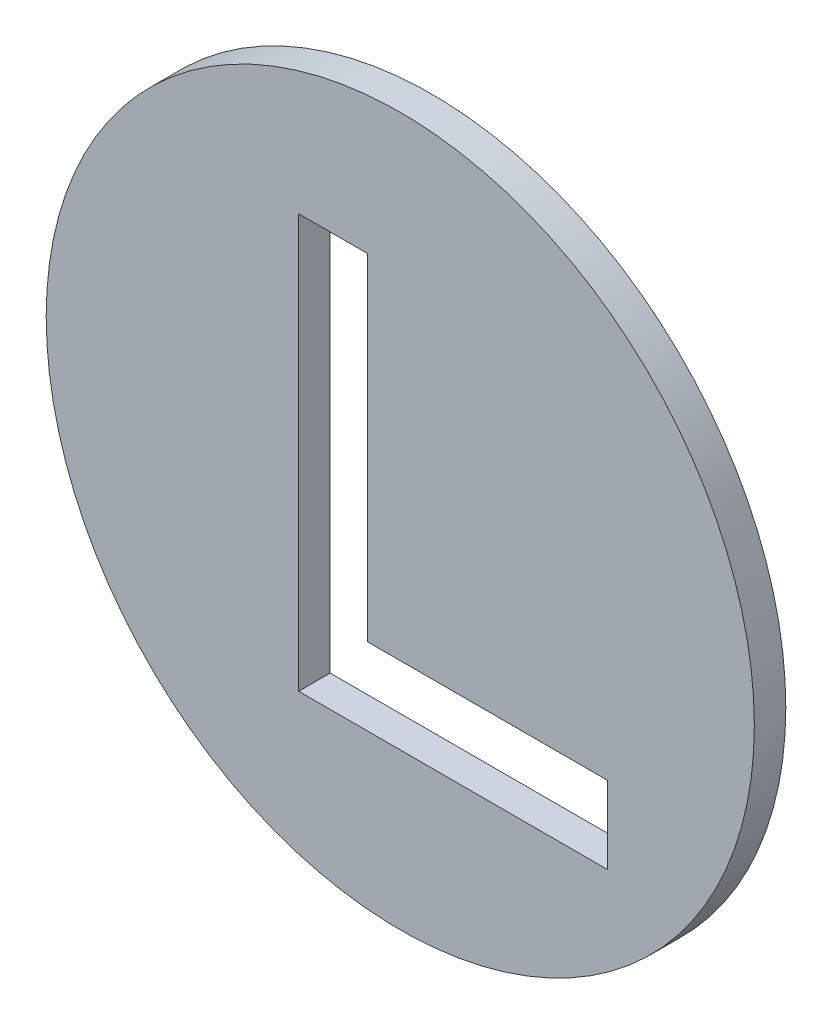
ISO-10303-21;
HEADER;
FILE_DESCRIPTION(('STEP AP214'),'2;1');
FILE_NAME('part.step','',(''),(''),'','','');
FILE_SCHEMA(('AUTOMOTIVE_DESIGN { 1 0 10303 214 1 1 1 1 }'));
ENDSEC;
DATA;
#1=APPLICATION_CONTEXT('core data for automotive mechanical design processes');
#2=APPLICATION_PROTOCOL_DEFINITION('international standard','automotive_design',2000,#1);
#3=PRODUCT_CONTEXT('',#1,'mechanical');
#4=PRODUCT('Part','Part','',(#3));
#5=PRODUCT_RELATED_PRODUCT_CATEGORY('part','',(#4));
#6=PRODUCT_DEFINITION_FORMATION('','',#4);
#7=PRODUCT_DEFINITION_CONTEXT('part definition',#1,'design');
#8=PRODUCT_DEFINITION('design','',#6,#7);
#9=PRODUCT_DEFINITION_SHAPE('','',#8);
#10=(LENGTH_UNIT() NAMED_UNIT(*) SI_UNIT(.MILLI.,.METRE.));
#11=(NAMED_UNIT(*) PLANE_ANGLE_UNIT() SI_UNIT($,.RADIAN.));
#12=(NAMED_UNIT(*) SI_UNIT($,.STERADIAN.) SOLID_ANGLE_UNIT());
#13=UNCERTAINTY_MEASURE_WITH_UNIT(LENGTH_MEASURE(1.E-05),#10,'distance_accuracy_value','');
#14=(GEOMETRIC_REPRESENTATION_CONTEXT(3) GLOBAL_UNCERTAINTY_ASSIGNED_CONTEXT((#13)) GLOBAL_UNIT_ASSIGNED_CONTEXT((#10,
#11,#12)) REPRESENTATION_CONTEXT('',''));
#15=CARTESIAN_POINT('',(0.,0.,0.));
#16=DIRECTION('',(0.,0.,1.));
#17=DIRECTION('',(1.,0.,0.));
#18=AXIS2_PLACEMENT_3D('',#15,#16,#17);
#19=CARTESIAN_POINT('',(0.,0.,4.));
#20=DIRECTION('',(0.,0.,-1.));
#21=DIRECTION('',(-1.,0.,0.));
#22=AXIS2_PLACEMENT_3D('',#19,#20,#21);
#23=CYLINDRICAL_SURFACE('',#22,45.);
#24=CARTESIAN_POINT('',(0.,0.,4.));
#25=DIRECTION('',(0.,0.,1.));
#26=DIRECTION('',(1.,0.,0.));
#27=AXIS2_PLACEMENT_3D('',#24,#25,#26);
#28=CIRCLE('',#27,45.);
#29=CARTESIAN_POINT('',(45.,0.,4.));
#30=VERTEX_POINT('',#29);
#31=EDGE_CURVE('E11',#30,#30,#28,.T.);
#32=ORIENTED_EDGE('',*,*,#31,.F.);
#33=EDGE_LOOP('',(#32));
#34=FACE_BOUND('',#33,.T.);
#35=CARTESIAN_POINT('',(0.,0.,0.));
#36=DIRECTION('',(0.,0.,1.));
#37=DIRECTION('',(1.,0.,0.));
#38=AXIS2_PLACEMENT_3D('',#35,#36,#37);
#39=CIRCLE('',#38,45.);
#40=CARTESIAN_POINT('',(45.,0.,0.));
#41=VERTEX_POINT('',#40);
#42=EDGE_CURVE('E36',#41,#41,#39,.T.);
#43=ORIENTED_EDGE('',*,*,#42,.T.);
#44=EDGE_LOOP('',(#43));
#45=FACE_BOUND('',#44,.T.);
#46=ADVANCED_FACE('F33',(#34,#45),#23,.T.);
#47=CARTESIAN_POINT('',(0.,0.,4.));
#48=DIRECTION('',(0.,0.,1.));
#49=DIRECTION('',(1.,0.,0.));
#50=AXIS2_PLACEMENT_3D('',#47,#48,#49);
#51=PLANE('',#50);
#52=DIRECTION('',(-1.,0.,0.));
#53=VECTOR('',#52,1.);
#54=CARTESIAN_POINT('',(-4.18241493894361,27.3675412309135,4.));
#55=LINE('',#54,#53);
#56=CARTESIAN_POINT('',(-4.18241493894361,27.3675412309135,4.));
#57=VERTEX_POINT('',#56);
#58=CARTESIAN_POINT('',(-12.9109330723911,27.3675412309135,4.));
#59=VERTEX_POINT('',#58);
#60=EDGE_CURVE('E47',#57,#59,#55,.T.);
#61=ORIENTED_EDGE('',*,*,#60,.F.);
#62=DIRECTION('',(0.,1.,0.));
#63=VECTOR('',#62,1.);
#64=CARTESIAN_POINT('',(-4.18241493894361,-15.3658287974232,4.));
#65=LINE('',#64,#63);
#66=CARTESIAN_POINT('',(-4.18241493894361,-15.3658287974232,4.));
#67=VERTEX_POINT('',#66);
#68=EDGE_CURVE('E104',#67,#57,#65,.T.);
#69=ORIENTED_EDGE('',*,*,#68,.F.);
#70=DIRECTION('',(-1.,0.,0.));
#71=VECTOR('',#70,1.);
#72=CARTESIAN_POINT('',(26.3673985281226,-15.3658287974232,4.));
#73=LINE('',#72,#71);
#74=CARTESIAN_POINT('',(26.3673985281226,-15.3658287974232,4.));
#75=VERTEX_POINT('',#74);
#76=EDGE_CURVE('E107',#75,#67,#73,.T.);
#77=ORIENTED_EDGE('',*,*,#76,.F.);
#78=DIRECTION('',(0.,1.,0.));
#79=VECTOR('',#78,1.);
#80=CARTESIAN_POINT('',(26.3673985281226,-25.1854116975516,4.));
#81=LINE('',#80,#79);
#82=CARTESIAN_POINT('',(26.3673985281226,-25.1854116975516,4.));
#83=VERTEX_POINT('',#82);
#84=EDGE_CURVE('E123',#83,#75,#81,.T.);
#85=ORIENTED_EDGE('',*,*,#84,.F.);
#86=DIRECTION('',(1.,0.,0.));
#87=VECTOR('',#86,1.);
#88=CARTESIAN_POINT('',(-12.9109330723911,-25.1854116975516,4.));
#89=LINE('',#88,#87);
#90=CARTESIAN_POINT('',(-12.9109330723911,-25.1854116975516,4.));
#91=VERTEX_POINT('',#90);
#92=EDGE_CURVE('E120',#91,#83,#89,.T.);
#93=ORIENTED_EDGE('',*,*,#92,.F.);
#94=DIRECTION('',(0.,-1.,0.));
#95=VECTOR('',#94,1.);
#96=CARTESIAN_POINT('',(-12.9109330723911,27.3675412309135,4.));
#97=LINE('',#96,#95);
#98=EDGE_CURVE('E118',#59,#91,#97,.T.);
#99=ORIENTED_EDGE('',*,*,#98,.F.);
#100=EDGE_LOOP('',(#61,#69,#77,#85,#93,#99));
#101=FACE_BOUND('',#100,.T.);
#102=ORIENTED_EDGE('',*,*,#31,.T.);
#103=EDGE_LOOP('',(#102));
#104=FACE_BOUND('',#103,.T.);
#105=ADVANCED_FACE('F140',(#101,#104),#51,.T.);
#106=CARTESIAN_POINT('',(0.,0.,0.));
#107=DIRECTION('',(0.,0.,1.));
#108=DIRECTION('',(1.,0.,0.));
#109=AXIS2_PLACEMENT_3D('',#106,#107,#108);
#110=PLANE('',#109);
#111=DIRECTION('',(0.,1.,0.));
#112=VECTOR('',#111,1.);
#113=CARTESIAN_POINT('',(-4.18241493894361,-15.3658287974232,0.));
#114=LINE('',#113,#112);
#115=CARTESIAN_POINT('',(-4.18241493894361,-15.3658287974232,0.));
#116=VERTEX_POINT('',#115);
#117=CARTESIAN_POINT('',(-4.18241493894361,27.3675412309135,0.));
#118=VERTEX_POINT('',#117);
#119=EDGE_CURVE('E93',#116,#118,#114,.T.);
#120=ORIENTED_EDGE('',*,*,#119,.T.);
#121=DIRECTION('',(-1.,0.,0.));
#122=VECTOR('',#121,1.);
#123=CARTESIAN_POINT('',(-4.18241493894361,27.3675412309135,0.));
#124=LINE('',#123,#122);
#125=CARTESIAN_POINT('',(-12.9109330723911,27.3675412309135,0.));
#126=VERTEX_POINT('',#125);
#127=EDGE_CURVE('E87',#118,#126,#124,.T.);
#128=ORIENTED_EDGE('',*,*,#127,.T.);
#129=DIRECTION('',(0.,-1.,0.));
#130=VECTOR('',#129,1.);
#131=CARTESIAN_POINT('',(-12.9109330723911,27.3675412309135,0.));
#132=LINE('',#131,#130);
#133=CARTESIAN_POINT('',(-12.9109330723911,-25.1854116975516,0.));
#134=VERTEX_POINT('',#133);
#135=EDGE_CURVE('E96',#126,#134,#132,.T.);
#136=ORIENTED_EDGE('',*,*,#135,.T.);
#137=DIRECTION('',(1.,0.,0.));
#138=VECTOR('',#137,1.);
#139=CARTESIAN_POINT('',(-12.9109330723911,-25.1854116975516,0.));
#140=LINE('',#139,#138);
#141=CARTESIAN_POINT('',(26.3673985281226,-25.1854116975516,0.));
#142=VERTEX_POINT('',#141);
#143=EDGE_CURVE('E55',#134,#142,#140,.T.);
#144=ORIENTED_EDGE('',*,*,#143,.T.);
#145=DIRECTION('',(0.,1.,0.));
#146=VECTOR('',#145,1.);
#147=CARTESIAN_POINT('',(26.3673985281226,-25.1854116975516,0.));
#148=LINE('',#147,#146);
#149=CARTESIAN_POINT('',(26.3673985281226,-15.3658287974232,0.));
#150=VERTEX_POINT('',#149);
#151=EDGE_CURVE('E111',#142,#150,#148,.T.);
#152=ORIENTED_EDGE('',*,*,#151,.T.);
#153=DIRECTION('',(-1.,0.,0.));
#154=VECTOR('',#153,1.);
#155=CARTESIAN_POINT('',(26.3673985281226,-15.3658287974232,0.));
#156=LINE('',#155,#154);
#157=EDGE_CURVE('E114',#150,#116,#156,.T.);
#158=ORIENTED_EDGE('',*,*,#157,.T.);
#159=EDGE_LOOP('',(#120,#128,#136,#144,#152,#158));
#160=FACE_BOUND('',#159,.T.);
#161=ORIENTED_EDGE('',*,*,#42,.F.);
#162=EDGE_LOOP('',(#161));
#163=FACE_BOUND('',#162,.T.);
#164=ADVANCED_FACE('F100',(#160,#163),#110,.F.);
#165=CARTESIAN_POINT('',(-4.18241493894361,27.3675412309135,0.));
#166=DIRECTION('',(0.,1.,0.));
#167=DIRECTION('',(0.,0.,1.));
#168=AXIS2_PLACEMENT_3D('',#165,#166,#167);
#169=PLANE('',#168);
#170=ORIENTED_EDGE('',*,*,#60,.T.);
#171=DIRECTION('',(0.,0.,1.));
#172=VECTOR('',#171,1.);
#173=CARTESIAN_POINT('',(-12.9109330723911,27.3675412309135,0.));
#174=LINE('',#173,#172);
#175=EDGE_CURVE('E83',#126,#59,#174,.T.);
#176=ORIENTED_EDGE('',*,*,#175,.F.);
#177=ORIENTED_EDGE('',*,*,#127,.F.);
#178=DIRECTION('',(0.,0.,1.));
#179=VECTOR('',#178,1.);
#180=CARTESIAN_POINT('',(-4.18241493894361,27.3675412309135,0.));
#181=LINE('',#180,#179);
#182=EDGE_CURVE('E128',#118,#57,#181,.T.);
#183=ORIENTED_EDGE('',*,*,#182,.T.);
#184=EDGE_LOOP('',(#170,#176,#177,#183));
#185=FACE_BOUND('',#184,.T.);
#186=ADVANCED_FACE('F85',(#185),#169,.F.);
#187=CARTESIAN_POINT('',(-4.18241493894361,-15.3658287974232,0.));
#188=DIRECTION('',(1.,0.,0.));
#189=DIRECTION('',(0.,0.,-1.));
#190=AXIS2_PLACEMENT_3D('',#187,#188,#189);
#191=PLANE('',#190);
#192=ORIENTED_EDGE('',*,*,#68,.T.);
#193=ORIENTED_EDGE('',*,*,#182,.F.);
#194=ORIENTED_EDGE('',*,*,#119,.F.);
#195=DIRECTION('',(0.,0.,1.));
#196=VECTOR('',#195,1.);
#197=CARTESIAN_POINT('',(-4.18241493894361,-15.3658287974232,0.));
#198=LINE('',#197,#196);
#199=EDGE_CURVE('E130',#116,#67,#198,.T.);
#200=ORIENTED_EDGE('',*,*,#199,.T.);
#201=EDGE_LOOP('',(#192,#193,#194,#200));
#202=FACE_BOUND('',#201,.T.);
#203=ADVANCED_FACE('F151',(#202),#191,.F.);
#204=CARTESIAN_POINT('',(26.3673985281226,-15.3658287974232,0.));
#205=DIRECTION('',(0.,1.,0.));
#206=DIRECTION('',(0.,0.,1.));
#207=AXIS2_PLACEMENT_3D('',#204,#205,#206);
#208=PLANE('',#207);
#209=ORIENTED_EDGE('',*,*,#76,.T.);
#210=ORIENTED_EDGE('',*,*,#199,.F.);
#211=ORIENTED_EDGE('',*,*,#157,.F.);
#212=DIRECTION('',(0.,0.,1.));
#213=VECTOR('',#212,1.);
#214=CARTESIAN_POINT('',(26.3673985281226,-15.3658287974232,0.));
#215=LINE('',#214,#213);
#216=EDGE_CURVE('E132',#150,#75,#215,.T.);
#217=ORIENTED_EDGE('',*,*,#216,.T.);
#218=EDGE_LOOP('',(#209,#210,#211,#217));
#219=FACE_BOUND('',#218,.T.);
#220=ADVANCED_FACE('F149',(#219),#208,.F.);
#221=CARTESIAN_POINT('',(26.3673985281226,-25.1854116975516,0.));
#222=DIRECTION('',(1.,0.,0.));
#223=DIRECTION('',(0.,0.,-1.));
#224=AXIS2_PLACEMENT_3D('',#221,#222,#223);
#225=PLANE('',#224);
#226=ORIENTED_EDGE('',*,*,#84,.T.);
#227=ORIENTED_EDGE('',*,*,#216,.F.);
#228=ORIENTED_EDGE('',*,*,#151,.F.);
#229=DIRECTION('',(0.,0.,1.));
#230=VECTOR('',#229,1.);
#231=CARTESIAN_POINT('',(26.3673985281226,-25.1854116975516,0.));
#232=LINE('',#231,#230);
#233=EDGE_CURVE('E134',#142,#83,#232,.T.);
#234=ORIENTED_EDGE('',*,*,#233,.T.);
#235=EDGE_LOOP('',(#226,#227,#228,#234));
#236=FACE_BOUND('',#235,.T.);
#237=ADVANCED_FACE('F145',(#236),#225,.F.);
#238=CARTESIAN_POINT('',(-12.9109330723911,-25.1854116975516,0.));
#239=DIRECTION('',(0.,-1.,0.));
#240=DIRECTION('',(0.,0.,-1.));
#241=AXIS2_PLACEMENT_3D('',#238,#239,#240);
#242=PLANE('',#241);
#243=ORIENTED_EDGE('',*,*,#92,.T.);
#244=ORIENTED_EDGE('',*,*,#233,.F.);
#245=ORIENTED_EDGE('',*,*,#143,.F.);
#246=DIRECTION('',(0.,0.,1.));
#247=VECTOR('',#246,1.);
#248=CARTESIAN_POINT('',(-12.9109330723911,-25.1854116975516,0.));
#249=LINE('',#248,#247);
#250=EDGE_CURVE('E92',#134,#91,#249,.T.);
#251=ORIENTED_EDGE('',*,*,#250,.T.);
#252=EDGE_LOOP('',(#243,#244,#245,#251));
#253=FACE_BOUND('',#252,.T.);
#254=ADVANCED_FACE('F136',(#253),#242,.F.);
#255=CARTESIAN_POINT('',(-12.9109330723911,27.3675412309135,0.));
#256=DIRECTION('',(-1.,0.,0.));
#257=DIRECTION('',(0.,0.,1.));
#258=AXIS2_PLACEMENT_3D('',#255,#256,#257);
#259=PLANE('',#258);
#260=ORIENTED_EDGE('',*,*,#98,.T.);
#261=ORIENTED_EDGE('',*,*,#250,.F.);
#262=ORIENTED_EDGE('',*,*,#135,.F.);
#263=ORIENTED_EDGE('',*,*,#175,.T.);
#264=EDGE_LOOP('',(#260,#261,#262,#263));
#265=FACE_BOUND('',#264,.T.);
#266=ADVANCED_FACE('F97',(#265),#259,.F.);
#267=CLOSED_SHELL('',(#46,#105,#164,#186,#203,#220,#237,#254,#266));
#268=MANIFOLD_SOLID_BREP('B2',#267);
#269=ADVANCED_BREP_SHAPE_REPRESENTATION('',(#18,#268),#14);
#270=SHAPE_DEFINITION_REPRESENTATION(#9,#269);
ENDSEC;
END-ISO-10303-21;
